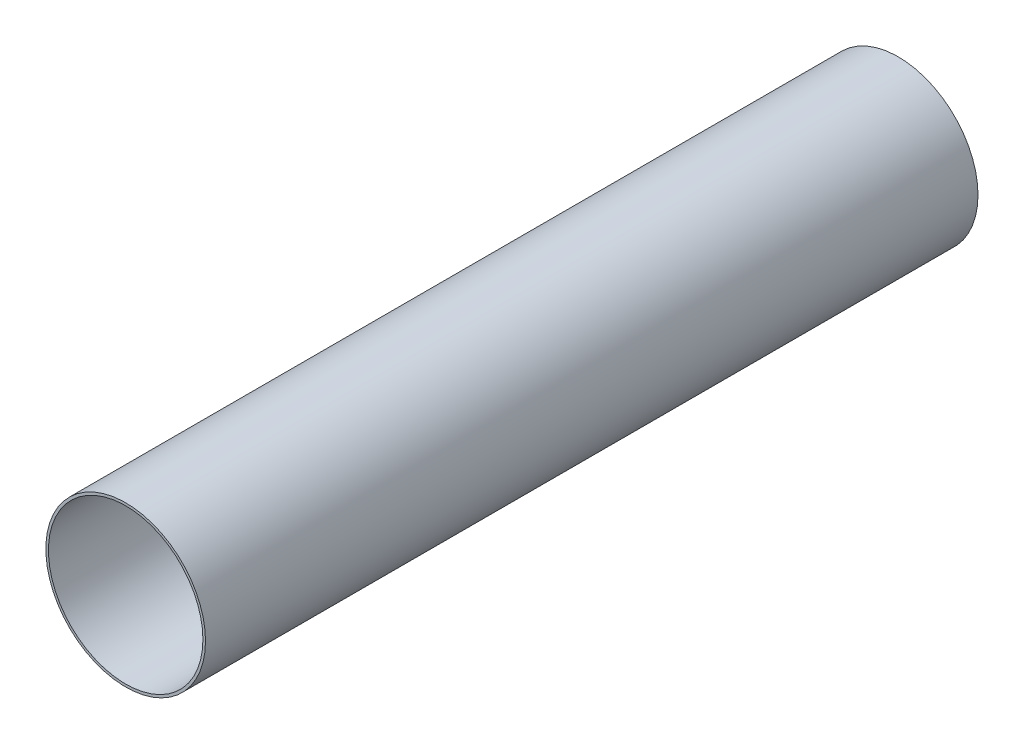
ISO-10303-21;
HEADER;
FILE_DESCRIPTION(('STEP AP214'),'2;1');
FILE_NAME('part.step','',(''),(''),'','','');
FILE_SCHEMA(('AUTOMOTIVE_DESIGN { 1 0 10303 214 1 1 1 1 }'));
ENDSEC;
DATA;
#1=APPLICATION_CONTEXT('core data for automotive mechanical design processes');
#2=APPLICATION_PROTOCOL_DEFINITION('international standard','automotive_design',2000,#1);
#3=PRODUCT_CONTEXT('',#1,'mechanical');
#4=PRODUCT('Part','Part','',(#3));
#5=PRODUCT_RELATED_PRODUCT_CATEGORY('part','',(#4));
#6=PRODUCT_DEFINITION_FORMATION('','',#4);
#7=PRODUCT_DEFINITION_CONTEXT('part definition',#1,'design');
#8=PRODUCT_DEFINITION('design','',#6,#7);
#9=PRODUCT_DEFINITION_SHAPE('','',#8);
#10=(LENGTH_UNIT() NAMED_UNIT(*) SI_UNIT(.MILLI.,.METRE.));
#11=(NAMED_UNIT(*) PLANE_ANGLE_UNIT() SI_UNIT($,.RADIAN.));
#12=(NAMED_UNIT(*) SI_UNIT($,.STERADIAN.) SOLID_ANGLE_UNIT());
#13=UNCERTAINTY_MEASURE_WITH_UNIT(LENGTH_MEASURE(1.E-05),#10,'distance_accuracy_value','');
#14=(GEOMETRIC_REPRESENTATION_CONTEXT(3) GLOBAL_UNCERTAINTY_ASSIGNED_CONTEXT((#13)) GLOBAL_UNIT_ASSIGNED_CONTEXT((#10,
#11,#12)) REPRESENTATION_CONTEXT('',''));
#15=CARTESIAN_POINT('',(0.,0.,0.));
#16=DIRECTION('',(0.,0.,1.));
#17=DIRECTION('',(1.,0.,0.));
#18=AXIS2_PLACEMENT_3D('',#15,#16,#17);
#19=CARTESIAN_POINT('',(0.,0.,15.));
#20=DIRECTION('',(0.,0.,1.));
#21=DIRECTION('',(1.,0.,0.));
#22=AXIS2_PLACEMENT_3D('',#19,#20,#21);
#23=PLANE('',#22);
#24=CARTESIAN_POINT('',(0.,0.,15.));
#25=DIRECTION('',(0.,0.,1.));
#26=DIRECTION('',(1.,0.,0.));
#27=AXIS2_PLACEMENT_3D('',#24,#25,#26);
#28=CIRCLE('',#27,1.55);
#29=CARTESIAN_POINT('',(1.55,0.,15.));
#30=VERTEX_POINT('',#29);
#31=EDGE_CURVE('E10',#30,#30,#28,.T.);
#32=ORIENTED_EDGE('',*,*,#31,.T.);
#33=EDGE_LOOP('',(#32));
#34=FACE_BOUND('',#33,.T.);
#35=CARTESIAN_POINT('',(0.,0.,15.));
#36=DIRECTION('',(0.,0.,1.));
#37=DIRECTION('',(1.,0.,0.));
#38=AXIS2_PLACEMENT_3D('',#35,#36,#37);
#39=CIRCLE('',#38,1.5);
#40=CARTESIAN_POINT('',(1.5,0.,15.));
#41=VERTEX_POINT('',#40);
#42=EDGE_CURVE('E39',#41,#41,#39,.T.);
#43=ORIENTED_EDGE('',*,*,#42,.F.);
#44=EDGE_LOOP('',(#43));
#45=FACE_BOUND('',#44,.T.);
#46=ADVANCED_FACE('F28',(#34,#45),#23,.T.);
#47=CARTESIAN_POINT('',(0.,0.,0.));
#48=DIRECTION('',(0.,0.,1.));
#49=DIRECTION('',(1.,0.,0.));
#50=AXIS2_PLACEMENT_3D('',#47,#48,#49);
#51=PLANE('',#50);
#52=CARTESIAN_POINT('',(0.,0.,0.));
#53=DIRECTION('',(0.,0.,1.));
#54=DIRECTION('',(1.,0.,0.));
#55=AXIS2_PLACEMENT_3D('',#52,#53,#54);
#56=CIRCLE('',#55,1.55);
#57=CARTESIAN_POINT('',(1.55,0.,0.));
#58=VERTEX_POINT('',#57);
#59=EDGE_CURVE('E32',#58,#58,#56,.T.);
#60=ORIENTED_EDGE('',*,*,#59,.F.);
#61=EDGE_LOOP('',(#60));
#62=FACE_BOUND('',#61,.T.);
#63=CARTESIAN_POINT('',(0.,0.,0.));
#64=DIRECTION('',(0.,0.,1.));
#65=DIRECTION('',(1.,0.,0.));
#66=AXIS2_PLACEMENT_3D('',#63,#64,#65);
#67=CIRCLE('',#66,1.5);
#68=CARTESIAN_POINT('',(1.5,0.,0.));
#69=VERTEX_POINT('',#68);
#70=EDGE_CURVE('E41',#69,#69,#67,.T.);
#71=ORIENTED_EDGE('',*,*,#70,.T.);
#72=EDGE_LOOP('',(#71));
#73=FACE_BOUND('',#72,.T.);
#74=ADVANCED_FACE('F51',(#62,#73),#51,.F.);
#75=CARTESIAN_POINT('',(0.,0.,15.));
#76=DIRECTION('',(0.,0.,-1.));
#77=DIRECTION('',(-1.,0.,0.));
#78=AXIS2_PLACEMENT_3D('',#75,#76,#77);
#79=CYLINDRICAL_SURFACE('',#78,1.55);
#80=ORIENTED_EDGE('',*,*,#31,.F.);
#81=EDGE_LOOP('',(#80));
#82=FACE_BOUND('',#81,.T.);
#83=ORIENTED_EDGE('',*,*,#59,.T.);
#84=EDGE_LOOP('',(#83));
#85=FACE_BOUND('',#84,.T.);
#86=ADVANCED_FACE('F30',(#82,#85),#79,.T.);
#87=CARTESIAN_POINT('',(0.,0.,15.));
#88=DIRECTION('',(0.,0.,-1.));
#89=DIRECTION('',(-1.,0.,0.));
#90=AXIS2_PLACEMENT_3D('',#87,#88,#89);
#91=CYLINDRICAL_SURFACE('',#90,1.5);
#92=ORIENTED_EDGE('',*,*,#42,.T.);
#93=EDGE_LOOP('',(#92));
#94=FACE_BOUND('',#93,.T.);
#95=ORIENTED_EDGE('',*,*,#70,.F.);
#96=EDGE_LOOP('',(#95));
#97=FACE_BOUND('',#96,.T.);
#98=ADVANCED_FACE('F47',(#94,#97),#91,.F.);
#99=CLOSED_SHELL('',(#46,#74,#86,#98));
#100=MANIFOLD_SOLID_BREP('B2',#99);
#101=ADVANCED_BREP_SHAPE_REPRESENTATION('',(#18,#100),#14);
#102=SHAPE_DEFINITION_REPRESENTATION(#9,#101);
ENDSEC;
END-ISO-10303-21;
